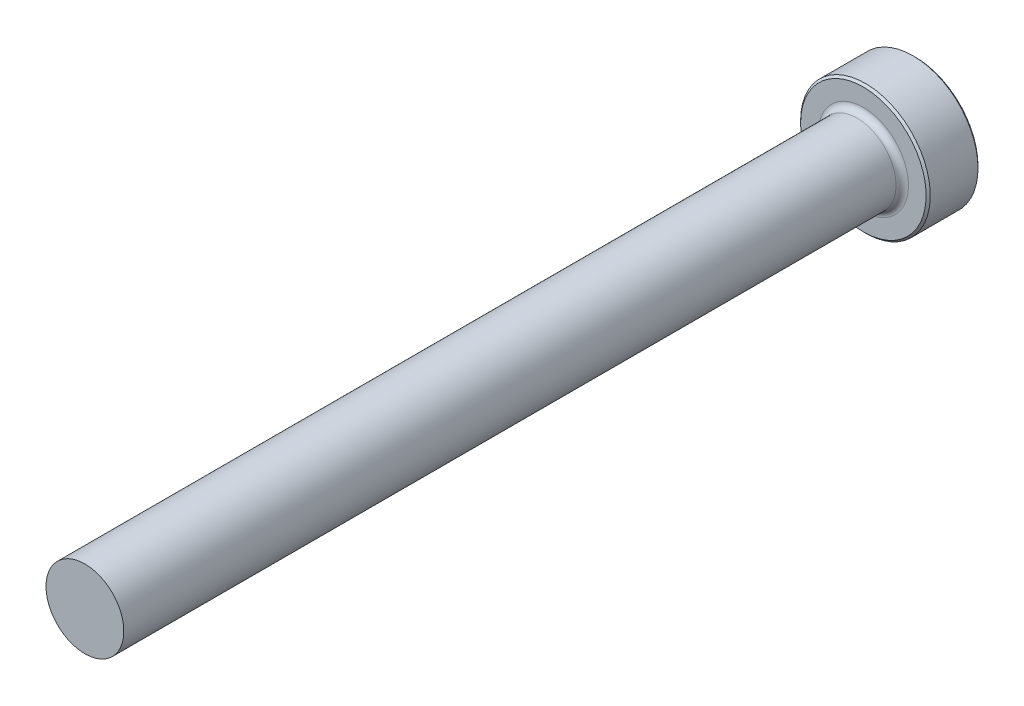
ISO-10303-21;
HEADER;
FILE_DESCRIPTION(('STEP AP214'),'2;1');
FILE_NAME('part.step','',(''),(''),'','','');
FILE_SCHEMA(('AUTOMOTIVE_DESIGN { 1 0 10303 214 1 1 1 1 }'));
ENDSEC;
DATA;
#1=APPLICATION_CONTEXT('core data for automotive mechanical design processes');
#2=APPLICATION_PROTOCOL_DEFINITION('international standard','automotive_design',2000,#1);
#3=PRODUCT_CONTEXT('',#1,'mechanical');
#4=PRODUCT('Part','Part','',(#3));
#5=PRODUCT_RELATED_PRODUCT_CATEGORY('part','',(#4));
#6=PRODUCT_DEFINITION_FORMATION('','',#4);
#7=PRODUCT_DEFINITION_CONTEXT('part definition',#1,'design');
#8=PRODUCT_DEFINITION('design','',#6,#7);
#9=PRODUCT_DEFINITION_SHAPE('','',#8);
#10=(LENGTH_UNIT() NAMED_UNIT(*) SI_UNIT(.MILLI.,.METRE.));
#11=(NAMED_UNIT(*) PLANE_ANGLE_UNIT() SI_UNIT($,.RADIAN.));
#12=(NAMED_UNIT(*) SI_UNIT($,.STERADIAN.) SOLID_ANGLE_UNIT());
#13=UNCERTAINTY_MEASURE_WITH_UNIT(LENGTH_MEASURE(1.E-05),#10,'distance_accuracy_value','');
#14=(GEOMETRIC_REPRESENTATION_CONTEXT(3) GLOBAL_UNCERTAINTY_ASSIGNED_CONTEXT((#13)) GLOBAL_UNIT_ASSIGNED_CONTEXT((#10,
#11,#12)) REPRESENTATION_CONTEXT('',''));
#15=CARTESIAN_POINT('',(0.,0.,0.));
#16=DIRECTION('',(0.,0.,1.));
#17=DIRECTION('',(1.,0.,0.));
#18=AXIS2_PLACEMENT_3D('',#15,#16,#17);
#19=CARTESIAN_POINT('',(0.,0.,0.));
#20=DIRECTION('',(0.,0.,1.));
#21=DIRECTION('',(1.,0.,0.));
#22=AXIS2_PLACEMENT_3D('',#19,#20,#21);
#23=PLANE('',#22);
#24=CARTESIAN_POINT('',(0.,0.,0.));
#25=DIRECTION('',(0.,0.,1.));
#26=DIRECTION('',(1.,0.,0.));
#27=AXIS2_PLACEMENT_3D('',#24,#25,#26);
#28=CIRCLE('',#27,7.68349999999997);
#29=CARTESIAN_POINT('',(7.68349999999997,0.,0.));
#30=VERTEX_POINT('',#29);
#31=EDGE_CURVE('E10',#30,#30,#28,.F.);
#32=ORIENTED_EDGE('',*,*,#31,.T.);
#33=EDGE_LOOP('',(#32));
#34=FACE_BOUND('',#33,.T.);
#35=ADVANCED_FACE('F32',(#34),#23,.F.);
#36=CARTESIAN_POINT('',(0.,0.,-2.14753999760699));
#37=DIRECTION('',(0.,0.,-1.));
#38=DIRECTION('',(-1.,0.,0.));
#39=AXIS2_PLACEMENT_3D('',#36,#37,#38);
#40=CYLINDRICAL_SURFACE('',#39,7.9375);
#41=CARTESIAN_POINT('',(0.,0.,6.096));
#42=DIRECTION('',(0.,0.,-1.));
#43=DIRECTION('',(-1.,0.,0.));
#44=AXIS2_PLACEMENT_3D('',#41,#42,#43);
#45=CIRCLE('',#44,7.9375);
#46=CARTESIAN_POINT('',(-7.9375,0.,6.096));
#47=VERTEX_POINT('',#46);
#48=EDGE_CURVE('E43',#47,#47,#45,.T.);
#49=ORIENTED_EDGE('',*,*,#48,.T.);
#50=EDGE_LOOP('',(#49));
#51=FACE_BOUND('',#50,.T.);
#52=CARTESIAN_POINT('',(0.,0.,0.254000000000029));
#53=DIRECTION('',(0.,0.,1.));
#54=DIRECTION('',(1.,0.,0.));
#55=AXIS2_PLACEMENT_3D('',#52,#53,#54);
#56=CIRCLE('',#55,7.9375);
#57=CARTESIAN_POINT('',(7.9375,0.,0.254000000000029));
#58=VERTEX_POINT('',#57);
#59=EDGE_CURVE('E47',#58,#58,#56,.T.);
#60=ORIENTED_EDGE('',*,*,#59,.T.);
#61=EDGE_LOOP('',(#60));
#62=FACE_BOUND('',#61,.T.);
#63=ADVANCED_FACE('F77',(#51,#62),#40,.T.);
#64=CARTESIAN_POINT('',(0.,-7.9375,6.35));
#65=DIRECTION('',(0.,0.,-1.));
#66=DIRECTION('',(-1.,0.,0.));
#67=AXIS2_PLACEMENT_3D('',#64,#65,#66);
#68=PLANE('',#67);
#69=CARTESIAN_POINT('',(0.,0.,6.35));
#70=DIRECTION('',(0.,0.,-1.));
#71=DIRECTION('',(-1.,0.,0.));
#72=AXIS2_PLACEMENT_3D('',#69,#70,#71);
#73=CIRCLE('',#72,7.6835);
#74=CARTESIAN_POINT('',(-7.6835,0.,6.35));
#75=VERTEX_POINT('',#74);
#76=EDGE_CURVE('E39',#75,#75,#73,.F.);
#77=ORIENTED_EDGE('',*,*,#76,.T.);
#78=EDGE_LOOP('',(#77));
#79=FACE_BOUND('',#78,.T.);
#80=CARTESIAN_POINT('',(0.,0.,6.35));
#81=DIRECTION('',(0.,0.,-1.));
#82=DIRECTION('',(-1.,0.,0.));
#83=AXIS2_PLACEMENT_3D('',#80,#81,#82);
#84=CIRCLE('',#83,5.52450000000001);
#85=CARTESIAN_POINT('',(-5.52450000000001,0.,6.35));
#86=VERTEX_POINT('',#85);
#87=EDGE_CURVE('E52',#86,#86,#84,.T.);
#88=ORIENTED_EDGE('',*,*,#87,.T.);
#89=EDGE_LOOP('',(#88));
#90=FACE_BOUND('',#89,.T.);
#91=ADVANCED_FACE('F82',(#79,#90),#68,.F.);
#92=CARTESIAN_POINT('',(0.,0.,7.112));
#93=DIRECTION('',(0.,0.,-1.));
#94=DIRECTION('',(-1.,0.,0.));
#95=AXIS2_PLACEMENT_3D('',#92,#93,#94);
#96=TOROIDAL_SURFACE('',#95,5.5245,0.762);
#97=ORIENTED_EDGE('',*,*,#87,.F.);
#98=EDGE_LOOP('',(#97));
#99=FACE_BOUND('',#98,.T.);
#100=CARTESIAN_POINT('',(0.,0.,7.11200000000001));
#101=DIRECTION('',(0.,0.,-1.));
#102=DIRECTION('',(-1.,0.,0.));
#103=AXIS2_PLACEMENT_3D('',#100,#101,#102);
#104=CIRCLE('',#103,4.7625);
#105=CARTESIAN_POINT('',(-4.7625,0.,7.11200000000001));
#106=VERTEX_POINT('',#105);
#107=EDGE_CURVE('E55',#106,#106,#104,.T.);
#108=ORIENTED_EDGE('',*,*,#107,.T.);
#109=EDGE_LOOP('',(#108));
#110=FACE_BOUND('',#109,.T.);
#111=ADVANCED_FACE('F73',(#99,#110),#96,.F.);
#112=CARTESIAN_POINT('',(0.,0.,-2.14753999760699));
#113=DIRECTION('',(0.,0.,-1.));
#114=DIRECTION('',(-1.,0.,0.));
#115=AXIS2_PLACEMENT_3D('',#112,#113,#114);
#116=CYLINDRICAL_SURFACE('',#115,4.7625);
#117=ORIENTED_EDGE('',*,*,#107,.F.);
#118=EDGE_LOOP('',(#117));
#119=FACE_BOUND('',#118,.T.);
#120=CARTESIAN_POINT('',(0.,0.,101.6254));
#121=DIRECTION('',(0.,0.,-1.));
#122=DIRECTION('',(-1.,0.,0.));
#123=AXIS2_PLACEMENT_3D('',#120,#121,#122);
#124=CIRCLE('',#123,4.7625);
#125=CARTESIAN_POINT('',(-4.7625,0.,101.6254));
#126=VERTEX_POINT('',#125);
#127=EDGE_CURVE('E58',#126,#126,#124,.T.);
#128=ORIENTED_EDGE('',*,*,#127,.T.);
#129=EDGE_LOOP('',(#128));
#130=FACE_BOUND('',#129,.T.);
#131=ADVANCED_FACE('F62',(#119,#130),#116,.T.);
#132=CARTESIAN_POINT('',(0.,0.,101.6254));
#133=DIRECTION('',(0.,0.,-1.));
#134=DIRECTION('',(-1.,0.,0.));
#135=AXIS2_PLACEMENT_3D('',#132,#133,#134);
#136=PLANE('',#135);
#137=ORIENTED_EDGE('',*,*,#127,.F.);
#138=EDGE_LOOP('',(#137));
#139=FACE_BOUND('',#138,.T.);
#140=ADVANCED_FACE('F64',(#139),#136,.F.);
#141=CARTESIAN_POINT('',(0.,0.,6.096));
#142=DIRECTION('',(0.,0.,-1.));
#143=DIRECTION('',(-1.,0.,0.));
#144=AXIS2_PLACEMENT_3D('',#141,#142,#143);
#145=CONICAL_SURFACE('',#144,7.9375,0.785398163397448);
#146=ORIENTED_EDGE('',*,*,#76,.F.);
#147=EDGE_LOOP('',(#146));
#148=FACE_BOUND('',#147,.T.);
#149=ORIENTED_EDGE('',*,*,#48,.F.);
#150=EDGE_LOOP('',(#149));
#151=FACE_BOUND('',#150,.T.);
#152=ADVANCED_FACE('F66',(#148,#151),#145,.T.);
#153=CARTESIAN_POINT('',(0.,0.,0.));
#154=DIRECTION('',(0.,0.,1.));
#155=DIRECTION('',(1.,0.,0.));
#156=AXIS2_PLACEMENT_3D('',#153,#154,#155);
#157=CONICAL_SURFACE('',#156,7.68349999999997,0.785398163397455);
#158=ORIENTED_EDGE('',*,*,#59,.F.);
#159=EDGE_LOOP('',(#158));
#160=FACE_BOUND('',#159,.T.);
#161=ORIENTED_EDGE('',*,*,#31,.F.);
#162=EDGE_LOOP('',(#161));
#163=FACE_BOUND('',#162,.T.);
#164=ADVANCED_FACE('F34',(#160,#163),#157,.T.);
#165=CLOSED_SHELL('',(#35,#63,#91,#111,#131,#140,#152,#164));
#166=MANIFOLD_SOLID_BREP('B2',#165);
#167=ADVANCED_BREP_SHAPE_REPRESENTATION('',(#18,#166),#14);
#168=SHAPE_DEFINITION_REPRESENTATION(#9,#167);
ENDSEC;
END-ISO-10303-21;
